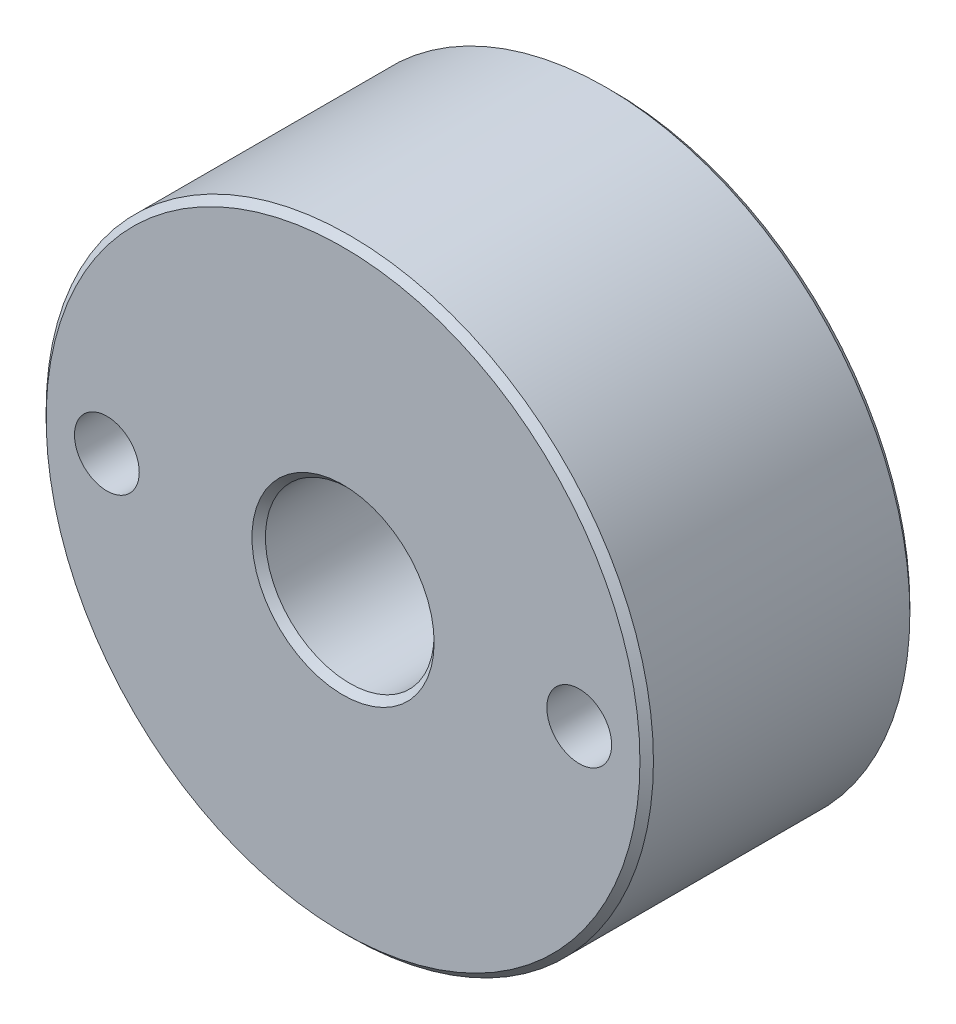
ISO-10303-21;
HEADER;
FILE_DESCRIPTION(('STEP AP214'),'2;1');
FILE_NAME('part.step','',(''),(''),'','','');
FILE_SCHEMA(('AUTOMOTIVE_DESIGN { 1 0 10303 214 1 1 1 1 }'));
ENDSEC;
DATA;
#1=APPLICATION_CONTEXT('core data for automotive mechanical design processes');
#2=APPLICATION_PROTOCOL_DEFINITION('international standard','automotive_design',2000,#1);
#3=PRODUCT_CONTEXT('',#1,'mechanical');
#4=PRODUCT('Part','Part','',(#3));
#5=PRODUCT_RELATED_PRODUCT_CATEGORY('part','',(#4));
#6=PRODUCT_DEFINITION_FORMATION('','',#4);
#7=PRODUCT_DEFINITION_CONTEXT('part definition',#1,'design');
#8=PRODUCT_DEFINITION('design','',#6,#7);
#9=PRODUCT_DEFINITION_SHAPE('','',#8);
#10=(LENGTH_UNIT() NAMED_UNIT(*) SI_UNIT(.MILLI.,.METRE.));
#11=(NAMED_UNIT(*) PLANE_ANGLE_UNIT() SI_UNIT($,.RADIAN.));
#12=(NAMED_UNIT(*) SI_UNIT($,.STERADIAN.) SOLID_ANGLE_UNIT());
#13=UNCERTAINTY_MEASURE_WITH_UNIT(LENGTH_MEASURE(1.E-05),#10,'distance_accuracy_value','');
#14=(GEOMETRIC_REPRESENTATION_CONTEXT(3) GLOBAL_UNCERTAINTY_ASSIGNED_CONTEXT((#13)) GLOBAL_UNIT_ASSIGNED_CONTEXT((#10,
#11,#12)) REPRESENTATION_CONTEXT('',''));
#15=CARTESIAN_POINT('',(0.,0.,0.));
#16=DIRECTION('',(0.,0.,1.));
#17=DIRECTION('',(1.,0.,0.));
#18=AXIS2_PLACEMENT_3D('',#15,#16,#17);
#19=CARTESIAN_POINT('',(0.,0.,20.));
#20=DIRECTION('',(0.,0.,1.));
#21=DIRECTION('',(1.,0.,0.));
#22=AXIS2_PLACEMENT_3D('',#19,#20,#21);
#23=PLANE('',#22);
#24=CARTESIAN_POINT('',(0.,0.,20.));
#25=DIRECTION('',(0.,0.,1.));
#26=DIRECTION('',(1.,0.,0.));
#27=AXIS2_PLACEMENT_3D('',#24,#25,#26);
#28=CIRCLE('',#27,22.);
#29=CARTESIAN_POINT('',(22.,0.,20.));
#30=VERTEX_POINT('',#29);
#31=EDGE_CURVE('E10',#30,#30,#28,.T.);
#32=ORIENTED_EDGE('',*,*,#31,.T.);
#33=EDGE_LOOP('',(#32));
#34=FACE_BOUND('',#33,.T.);
#35=CARTESIAN_POINT('',(0.,0.,20.));
#36=DIRECTION('',(0.,0.,1.));
#37=DIRECTION('',(1.,0.,0.));
#38=AXIS2_PLACEMENT_3D('',#35,#36,#37);
#39=CIRCLE('',#38,6.75000000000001);
#40=CARTESIAN_POINT('',(6.75000000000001,0.,20.));
#41=VERTEX_POINT('',#40);
#42=EDGE_CURVE('E33',#41,#41,#39,.F.);
#43=ORIENTED_EDGE('',*,*,#42,.T.);
#44=EDGE_LOOP('',(#43));
#45=FACE_BOUND('',#44,.T.);
#46=CARTESIAN_POINT('',(-17.5,0.,20.));
#47=DIRECTION('',(0.,0.,1.));
#48=DIRECTION('',(1.,0.,0.));
#49=AXIS2_PLACEMENT_3D('',#46,#47,#48);
#50=CIRCLE('',#49,2.39999999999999);
#51=CARTESIAN_POINT('',(-15.1,0.,20.));
#52=VERTEX_POINT('',#51);
#53=EDGE_CURVE('E64',#52,#52,#50,.T.);
#54=ORIENTED_EDGE('',*,*,#53,.F.);
#55=EDGE_LOOP('',(#54));
#56=FACE_BOUND('',#55,.T.);
#57=CARTESIAN_POINT('',(17.5,0.,20.));
#58=DIRECTION('',(0.,0.,1.));
#59=DIRECTION('',(1.,0.,0.));
#60=AXIS2_PLACEMENT_3D('',#57,#58,#59);
#61=CIRCLE('',#60,2.39999999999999);
#62=CARTESIAN_POINT('',(19.9,0.,20.));
#63=VERTEX_POINT('',#62);
#64=EDGE_CURVE('E58',#63,#63,#61,.T.);
#65=ORIENTED_EDGE('',*,*,#64,.F.);
#66=EDGE_LOOP('',(#65));
#67=FACE_BOUND('',#66,.T.);
#68=ADVANCED_FACE('F26',(#34,#45,#56,#67),#23,.T.);
#69=CARTESIAN_POINT('',(0.,0.,0.));
#70=DIRECTION('',(0.,0.,1.));
#71=DIRECTION('',(1.,0.,0.));
#72=AXIS2_PLACEMENT_3D('',#69,#70,#71);
#73=PLANE('',#72);
#74=CARTESIAN_POINT('',(0.,0.,0.));
#75=DIRECTION('',(0.,0.,1.));
#76=DIRECTION('',(1.,0.,0.));
#77=AXIS2_PLACEMENT_3D('',#74,#75,#76);
#78=CIRCLE('',#77,6.75);
#79=CARTESIAN_POINT('',(6.75,0.,0.));
#80=VERTEX_POINT('',#79);
#81=EDGE_CURVE('E52',#80,#80,#78,.T.);
#82=ORIENTED_EDGE('',*,*,#81,.T.);
#83=EDGE_LOOP('',(#82));
#84=FACE_BOUND('',#83,.T.);
#85=CARTESIAN_POINT('',(0.,0.,0.));
#86=DIRECTION('',(0.,0.,1.));
#87=DIRECTION('',(1.,0.,0.));
#88=AXIS2_PLACEMENT_3D('',#85,#86,#87);
#89=CIRCLE('',#88,22.);
#90=CARTESIAN_POINT('',(22.,0.,0.));
#91=VERTEX_POINT('',#90);
#92=EDGE_CURVE('E55',#91,#91,#89,.F.);
#93=ORIENTED_EDGE('',*,*,#92,.T.);
#94=EDGE_LOOP('',(#93));
#95=FACE_BOUND('',#94,.T.);
#96=CARTESIAN_POINT('',(-17.5,0.,0.));
#97=DIRECTION('',(0.,0.,1.));
#98=DIRECTION('',(1.,0.,0.));
#99=AXIS2_PLACEMENT_3D('',#96,#97,#98);
#100=CIRCLE('',#99,2.4);
#101=CARTESIAN_POINT('',(-15.1,0.,0.));
#102=VERTEX_POINT('',#101);
#103=EDGE_CURVE('E67',#102,#102,#100,.T.);
#104=ORIENTED_EDGE('',*,*,#103,.T.);
#105=EDGE_LOOP('',(#104));
#106=FACE_BOUND('',#105,.T.);
#107=CARTESIAN_POINT('',(17.5,0.,0.));
#108=DIRECTION('',(0.,0.,1.));
#109=DIRECTION('',(1.,0.,0.));
#110=AXIS2_PLACEMENT_3D('',#107,#108,#109);
#111=CIRCLE('',#110,2.4);
#112=CARTESIAN_POINT('',(19.9,0.,0.));
#113=VERTEX_POINT('',#112);
#114=EDGE_CURVE('E61',#113,#113,#111,.T.);
#115=ORIENTED_EDGE('',*,*,#114,.T.);
#116=EDGE_LOOP('',(#115));
#117=FACE_BOUND('',#116,.T.);
#118=ADVANCED_FACE('F71',(#84,#95,#106,#117),#73,.F.);
#119=CARTESIAN_POINT('',(0.,0.,20.));
#120=DIRECTION('',(0.,0.,-1.));
#121=DIRECTION('',(-1.,0.,0.));
#122=AXIS2_PLACEMENT_3D('',#119,#120,#121);
#123=CYLINDRICAL_SURFACE('',#122,22.5);
#124=CARTESIAN_POINT('',(0.,0.,0.500000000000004));
#125=DIRECTION('',(0.,0.,1.));
#126=DIRECTION('',(1.,0.,0.));
#127=AXIS2_PLACEMENT_3D('',#124,#125,#126);
#128=CIRCLE('',#127,22.5);
#129=CARTESIAN_POINT('',(22.5,0.,0.500000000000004));
#130=VERTEX_POINT('',#129);
#131=EDGE_CURVE('E37',#130,#130,#128,.T.);
#132=ORIENTED_EDGE('',*,*,#131,.T.);
#133=EDGE_LOOP('',(#132));
#134=FACE_BOUND('',#133,.T.);
#135=CARTESIAN_POINT('',(0.,0.,19.5));
#136=DIRECTION('',(0.,0.,1.));
#137=DIRECTION('',(1.,0.,0.));
#138=AXIS2_PLACEMENT_3D('',#135,#136,#137);
#139=CIRCLE('',#138,22.5);
#140=CARTESIAN_POINT('',(22.5,0.,19.5));
#141=VERTEX_POINT('',#140);
#142=EDGE_CURVE('E41',#141,#141,#139,.F.);
#143=ORIENTED_EDGE('',*,*,#142,.T.);
#144=EDGE_LOOP('',(#143));
#145=FACE_BOUND('',#144,.T.);
#146=ADVANCED_FACE('F28',(#134,#145),#123,.T.);
#147=CARTESIAN_POINT('',(0.,0.,20.));
#148=DIRECTION('',(0.,0.,-1.));
#149=DIRECTION('',(-1.,0.,0.));
#150=AXIS2_PLACEMENT_3D('',#147,#148,#149);
#151=CYLINDRICAL_SURFACE('',#150,6.25);
#152=CARTESIAN_POINT('',(0.,0.,0.5));
#153=DIRECTION('',(0.,0.,1.));
#154=DIRECTION('',(1.,0.,0.));
#155=AXIS2_PLACEMENT_3D('',#152,#153,#154);
#156=CIRCLE('',#155,6.25);
#157=CARTESIAN_POINT('',(6.25,0.,0.5));
#158=VERTEX_POINT('',#157);
#159=EDGE_CURVE('E46',#158,#158,#156,.F.);
#160=ORIENTED_EDGE('',*,*,#159,.T.);
#161=EDGE_LOOP('',(#160));
#162=FACE_BOUND('',#161,.T.);
#163=CARTESIAN_POINT('',(0.,0.,19.5));
#164=DIRECTION('',(0.,0.,1.));
#165=DIRECTION('',(1.,0.,0.));
#166=AXIS2_PLACEMENT_3D('',#163,#164,#165);
#167=CIRCLE('',#166,6.25);
#168=CARTESIAN_POINT('',(6.25,0.,19.5));
#169=VERTEX_POINT('',#168);
#170=EDGE_CURVE('E49',#169,#169,#167,.T.);
#171=ORIENTED_EDGE('',*,*,#170,.T.);
#172=EDGE_LOOP('',(#171));
#173=FACE_BOUND('',#172,.T.);
#174=ADVANCED_FACE('F87',(#162,#173),#151,.F.);
#175=CARTESIAN_POINT('',(17.5,0.,20.));
#176=DIRECTION('',(0.,0.,1.));
#177=DIRECTION('',(1.,0.,0.));
#178=AXIS2_PLACEMENT_3D('',#175,#176,#177);
#179=CYLINDRICAL_SURFACE('',#178,2.39999999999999);
#180=ORIENTED_EDGE('',*,*,#114,.F.);
#181=EDGE_LOOP('',(#180));
#182=FACE_BOUND('',#181,.T.);
#183=ORIENTED_EDGE('',*,*,#64,.T.);
#184=EDGE_LOOP('',(#183));
#185=FACE_BOUND('',#184,.T.);
#186=ADVANCED_FACE('F78',(#182,#185),#179,.F.);
#187=CARTESIAN_POINT('',(-17.5,0.,20.));
#188=DIRECTION('',(0.,0.,1.));
#189=DIRECTION('',(1.,0.,0.));
#190=AXIS2_PLACEMENT_3D('',#187,#188,#189);
#191=CYLINDRICAL_SURFACE('',#190,2.39999999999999);
#192=ORIENTED_EDGE('',*,*,#103,.F.);
#193=EDGE_LOOP('',(#192));
#194=FACE_BOUND('',#193,.T.);
#195=ORIENTED_EDGE('',*,*,#53,.T.);
#196=EDGE_LOOP('',(#195));
#197=FACE_BOUND('',#196,.T.);
#198=ADVANCED_FACE('F74',(#194,#197),#191,.F.);
#199=CARTESIAN_POINT('',(0.,0.,0.));
#200=DIRECTION('',(0.,0.,-1.));
#201=DIRECTION('',(-1.,0.,0.));
#202=AXIS2_PLACEMENT_3D('',#199,#200,#201);
#203=CONICAL_SURFACE('',#202,6.75,0.785398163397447);
#204=ORIENTED_EDGE('',*,*,#159,.F.);
#205=EDGE_LOOP('',(#204));
#206=FACE_BOUND('',#205,.T.);
#207=ORIENTED_EDGE('',*,*,#81,.F.);
#208=EDGE_LOOP('',(#207));
#209=FACE_BOUND('',#208,.T.);
#210=ADVANCED_FACE('F77',(#206,#209),#203,.F.);
#211=CARTESIAN_POINT('',(0.,0.,0.500000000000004));
#212=DIRECTION('',(0.,0.,1.));
#213=DIRECTION('',(1.,0.,0.));
#214=AXIS2_PLACEMENT_3D('',#211,#212,#213);
#215=CONICAL_SURFACE('',#214,22.5,0.785398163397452);
#216=ORIENTED_EDGE('',*,*,#92,.F.);
#217=EDGE_LOOP('',(#216));
#218=FACE_BOUND('',#217,.T.);
#219=ORIENTED_EDGE('',*,*,#131,.F.);
#220=EDGE_LOOP('',(#219));
#221=FACE_BOUND('',#220,.T.);
#222=ADVANCED_FACE('F108',(#218,#221),#215,.T.);
#223=CARTESIAN_POINT('',(0.,0.,20.));
#224=DIRECTION('',(0.,0.,-1.));
#225=DIRECTION('',(-1.,0.,0.));
#226=AXIS2_PLACEMENT_3D('',#223,#224,#225);
#227=CONICAL_SURFACE('',#226,22.,0.785398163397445);
#228=ORIENTED_EDGE('',*,*,#142,.F.);
#229=EDGE_LOOP('',(#228));
#230=FACE_BOUND('',#229,.T.);
#231=ORIENTED_EDGE('',*,*,#31,.F.);
#232=EDGE_LOOP('',(#231));
#233=FACE_BOUND('',#232,.T.);
#234=ADVANCED_FACE('F111',(#230,#233),#227,.T.);
#235=CARTESIAN_POINT('',(0.,0.,19.5));
#236=DIRECTION('',(0.,0.,1.));
#237=DIRECTION('',(1.,0.,0.));
#238=AXIS2_PLACEMENT_3D('',#235,#236,#237);
#239=CONICAL_SURFACE('',#238,6.25,0.785398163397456);
#240=ORIENTED_EDGE('',*,*,#42,.F.);
#241=EDGE_LOOP('',(#240));
#242=FACE_BOUND('',#241,.T.);
#243=ORIENTED_EDGE('',*,*,#170,.F.);
#244=EDGE_LOOP('',(#243));
#245=FACE_BOUND('',#244,.T.);
#246=ADVANCED_FACE('F119',(#242,#245),#239,.F.);
#247=CLOSED_SHELL('',(#68,#118,#146,#174,#186,#198,#210,#222,#234,#246));
#248=MANIFOLD_SOLID_BREP('B2',#247);
#249=ADVANCED_BREP_SHAPE_REPRESENTATION('',(#18,#248),#14);
#250=SHAPE_DEFINITION_REPRESENTATION(#9,#249);
ENDSEC;
END-ISO-10303-21;
